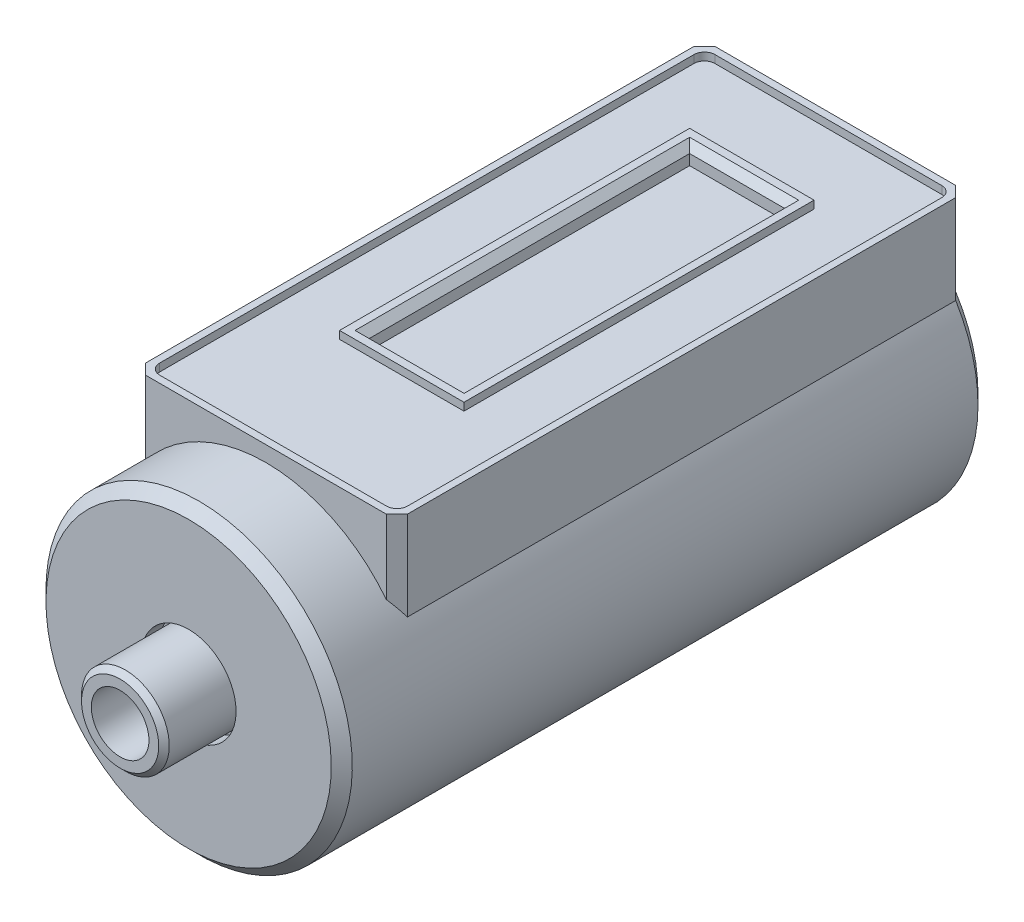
from build123d import *

# Parameters (mm, degrees)
EXTRUDE1_DEPTH     = 12.19
CHAMFER1_SIZE      = 0.76
SKETCH4_W          = 8.99
SKETCH4_H          = 25.3
CUT_EXTRUDE1_DEPTH = 0.56
SKETCH5_W          = 6.86
SKETCH5_H          = 23.16
CUT_EXTRUDE2_DEPTH = 1.27
CHAMFER2_SIZE      = 0.51
HOLE1_D            = 4.1656
HOLE1_DEPTH        = 6.35
HOLE1_TIP          = 1.251472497


with BuildPart() as part:
    # Sketch2 → Revolve1 (revolve)
    with BuildSketch(Plane(origin=(0, 0, 0), x_dir=(0, 0, -1), z_dir=(1, 0, 0))):
        Polygon((59.435, 0), (59.435, 2.79), (59.815, 3.17), (65.655, 3.17), (65.655, 3.43), (64.385, 3.43), (64.385, 10.31), (65.145, 11.07), (111.125, 11.07), (111.125, 0), align=None)
    revolve(axis=Axis((0, 0, -111.125), (0, 0, 1)))

    # Sketch3 → Extrude1 (add)
    with BuildSketch(Plane(origin=(0, 0, 0), x_dir=(1, 0, 0), z_dir=(0, 1, 0))):
        Polygon((-9.46, 111.125), (9.46, 111.125), (9.46, 70.735), (8.7, 69.975), (-8.7, 69.975), (-9.46, 70.735), align=None)
    extrude(amount=EXTRUDE1_DEPTH)

    # Chamfer1
    chamfer1_edges = [part.edges().sort_by_distance(p)[0] for p in [
        (0, -11.07, -111.125),
        (-9.46, 8.969599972, -111.125),
        (9.46, 8.969599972, -111.125),
    ]]
    chamfer(chamfer1_edges, length=CHAMFER1_SIZE)

    # Sketch4 → Cut-Extrude1 (cut)
    with BuildSketch(Plane(origin=(0, 12.19, 0), x_dir=(1, 0, 0), z_dir=(0, 1, 0))):
        with BuildLine():
            Line((-8.19, 110.615), (8.2, 110.615))
            ThreePointArc((8.2, 110.615), (8.737401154, 110.392401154), (8.96, 109.855))
            Line((8.96, 109.855), (8.96, 71.245))
            ThreePointArc((8.96, 71.245), (8.737401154, 70.707598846), (8.2, 70.485))
            Line((8.2, 70.485), (-8.19, 70.485))
            ThreePointArc((-8.19, 70.485), (-8.727401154, 70.707598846), (-8.95, 71.245))
            Line((-8.95, 71.245), (-8.95, 109.855))
            ThreePointArc((-8.95, 109.855), (-8.727401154, 110.392401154), (-8.19, 110.615))
        make_face()
        with Locations((0.005, 92.435)):
            Rectangle(SKETCH4_W, SKETCH4_H, mode=Mode.SUBTRACT)
    extrude(amount=-CUT_EXTRUDE1_DEPTH, mode=Mode.SUBTRACT)

    # Sketch5 → Cut-Extrude2 (cut)
    with BuildSketch(Plane(origin=(0, 12.19, 0), x_dir=(1, 0, 0), z_dir=(0, 1, 0))):
        with Locations((0.01, 92.435)):
            Rectangle(SKETCH5_W, SKETCH5_H)
    extrude(amount=-CUT_EXTRUDE2_DEPTH, mode=Mode.SUBTRACT)

    # Chamfer2
    chamfer2_edges = [part.edges().sort_by_distance(p)[0] for p in [
        (-3.42, 12.19, -92.435),
        (0.01, 12.19, -80.855),
        (3.44, 12.19, -92.435),
        (0.01, 12.19, -104.015),
    ]]
    chamfer(chamfer2_edges, length=CHAMFER2_SIZE)

    # Hole1
    with Locations(Plane.XY.offset(-59.435)):
        with Locations((0, 0)):
            Hole(HOLE1_D / 2, depth=HOLE1_DEPTH)
            with Locations((0, 0, -(HOLE1_DEPTH + HOLE1_TIP / 2))):  # 118° drill point
                Cone(0, HOLE1_D / 2, HOLE1_TIP, mode=Mode.SUBTRACT)


solid = part.part
